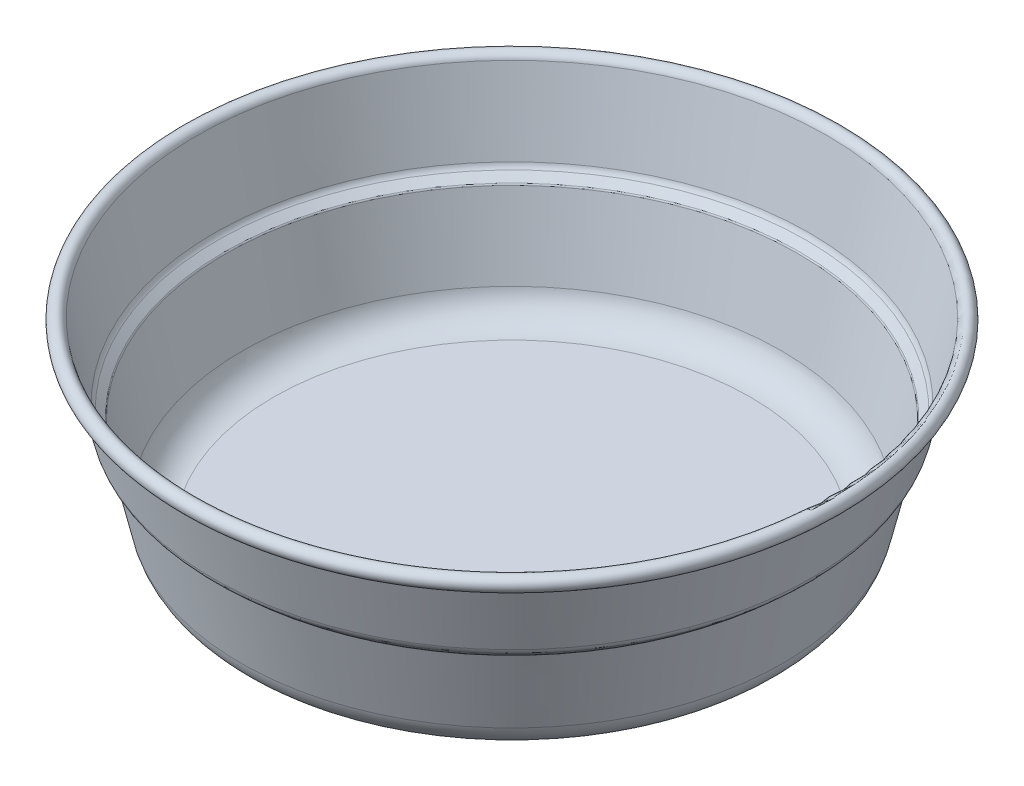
from build123d import *


with BuildPart() as part:
    # Esquisse2 → R_vol.-Mince1 (revolve)
    with BuildSketch(Plane.XY, mode=Mode.PRIVATE) as r_vol_mince1_sk:
        with BuildLine():
            Line((0, 0), (42.729229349, 0))
            ThreePointArc((42.729229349, 0), (46.463432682, 1.303647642), (48.574940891, 4.64809151))
            Line((48.574940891, 4.64809151), (51.685642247, 18.098900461))
            ThreePointArc((51.685642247, 18.098900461), (51.708518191, 18.155927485), (51.747626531, 18.203318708))
            Line((51.747626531, 18.203318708), (53.023734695, 19.337637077))
            ThreePointArc((53.023734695, 19.337637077), (53.414818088, 19.811549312), (53.643577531, 20.381819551))
            Line((53.643577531, 20.381819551), (56.775714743, 33.925318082))
            ThreePointArc((56.775714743, 33.925318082), (58.532725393, 34.322367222), (57.75, 32.7))
            Line((57.75, 32.7), (57.75, 32.4))
            ThreePointArc((57.75, 32.4), (58.767543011, 34.509077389), (56.483429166, 33.992913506))
            Line((56.483429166, 33.992913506), (53.351291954, 20.449414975))
            ThreePointArc((53.351291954, 20.449414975), (53.156846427, 19.964685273), (52.824425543, 19.561859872))
            Line((52.824425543, 19.561859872), (51.548317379, 18.427541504))
            ThreePointArc((51.548317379, 18.427541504), (51.450546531, 18.309063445), (51.39335667, 18.166495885))
            Line((51.39335667, 18.166495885), (48.282655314, 4.715686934))
            ThreePointArc((48.282655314, 4.715686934), (46.276722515, 1.53846526), (42.729229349, 0.3))
            Line((42.729229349, 0.3), (0, 0.3))
            Line((0, 0.3), (0, 0))
        make_face()
    revolve(r_vol_mince1_sk.sketch.rotate(Axis((0, 0, 0), (0, 1, 0)), 90), axis=Axis((0, 0, 0), (0, 1, 0)))


solid = part.part
